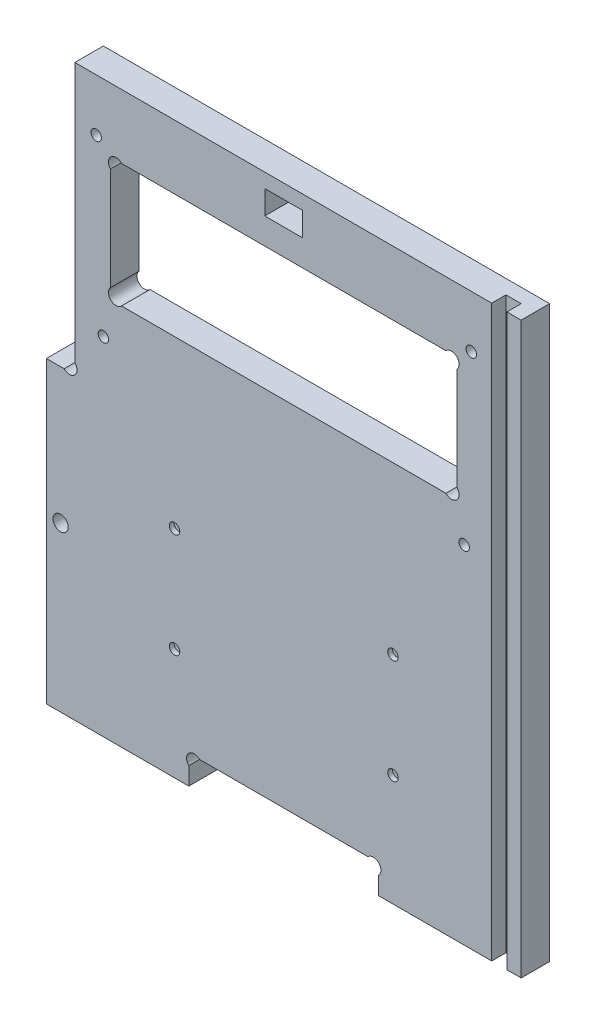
from build123d import *

# Parameters (mm, degrees)
ESQUISSE1_R             = 1.1
ESQUISSE1_R_2           = 1.6
ESQUISSE1_W             = 8
ESQUISSE1_H             = 5
BOSS_EXTRU_1_DEPTH      = 6
ESQUISSE2_R             = 1.1
ENL_V_MAT_EXTRU_3_DEPTH = 1
ESQUISSE3_W             = 3.2
ESQUISSE3_H             = 125.102693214
ENL_V_MAT_EXTRU_4_DEPTH = 3


with BuildPart() as part:
    # Esquisse1 → Boss.-Extru.1 (new body)
    with BuildSketch(Plane.XY):
        with BuildLine():
            Line((-44, 114), (50, 114))
            Line((50, 114), (50, -6))
            Line((50, -6), (20, -6))
            Line((20, -6), (20, -2.2627417))
            ThreePointArc((20, -2.2627417), (20, 0), (17.7372583, 0))
            Line((17.7372583, 0), (-17.7372583, 0))
            ThreePointArc((-17.7372583, 0), (-20, 0), (-20, -2.2627417))
            Line((-20, -2.2627417), (-20, -6))
            Line((-20, -6), (-50, -6))
            Line((-50, -6), (-50, 57))
            Line((-50, 57), (-46.2627417, 57))
            ThreePointArc((-46.2627417, 57), (-44, 57), (-44, 59.2627417))
            Line((-44, 59.2627417), (-44, 114))
        make_face()
        with Locations((-39.5, 103)):
            Circle(ESQUISSE1_R, mode=Mode.SUBTRACT)
        with Locations((-38, 67)):
            Circle(ESQUISSE1_R, mode=Mode.SUBTRACT)
        with Locations(Location((39.5, 103, 0), (0, 0, 180))):
            Circle(ESQUISSE1_R, mode=Mode.SUBTRACT)
        with Locations(Location((38, 67, 0), (0, 0, 180))):
            Circle(ESQUISSE1_R, mode=Mode.SUBTRACT)
        with Locations(Location((-47, 28.5, 0), (0, 0, 180))):
            Circle(ESQUISSE1_R_2, mode=Mode.SUBTRACT)
        with Locations((0, 108.5)):
            Rectangle(ESQUISSE1_W, ESQUISSE1_H, mode=Mode.SUBTRACT)
        with BuildLine():
            Line((-34.159194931, 100.5), (34.159194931, 100.5))
            ThreePointArc((34.159194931, 100.5), (36.420541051, 100.579458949), (36.5, 98.318112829))
            Line((36.5, 98.318112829), (36.5, 76.681887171))
            ThreePointArc((36.5, 76.681887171), (36.420541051, 74.420541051), (34.159194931, 74.5))
            Line((34.159194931, 74.5), (-34.159194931, 74.5))
            ThreePointArc((-34.159194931, 74.5), (-36.420541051, 74.420541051), (-36.5, 76.681887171))
            Line((-36.5, 76.681887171), (-36.5, 98.318112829))
            ThreePointArc((-36.5, 98.318112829), (-36.420541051, 100.579458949), (-34.159194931, 100.5))
        make_face(mode=Mode.SUBTRACT)
    extrude(amount=BOSS_EXTRU_1_DEPTH)

    # Esquisse2 → Enl_v. mat.-Extru.3 (cut)
    with BuildSketch(Plane(origin=(0, 0, 6), x_dir=(-1, 0, 0), z_dir=(0, 0, -1))):
        with Locations((-23, 39.5)):
            Circle(ESQUISSE2_R)
        with Locations((23, 39.5)):
            Circle(ESQUISSE2_R)
        with Locations((-23, 17.5)):
            Circle(ESQUISSE2_R)
        with Locations((23, 17.5)):
            Circle(ESQUISSE2_R)
    extrude(amount=ENL_V_MAT_EXTRU_3_DEPTH, mode=Mode.SUBTRACT)

    # Esquisse3 → Enl_v. mat.-Extru.4 (cut)
    with BuildSketch(Plane.XY.offset(6)):
        with Locations((45.4, 54.630242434)):
            Rectangle(ESQUISSE3_W, ESQUISSE3_H)
    extrude(amount=-ENL_V_MAT_EXTRU_4_DEPTH, mode=Mode.SUBTRACT)


solid = part.part
